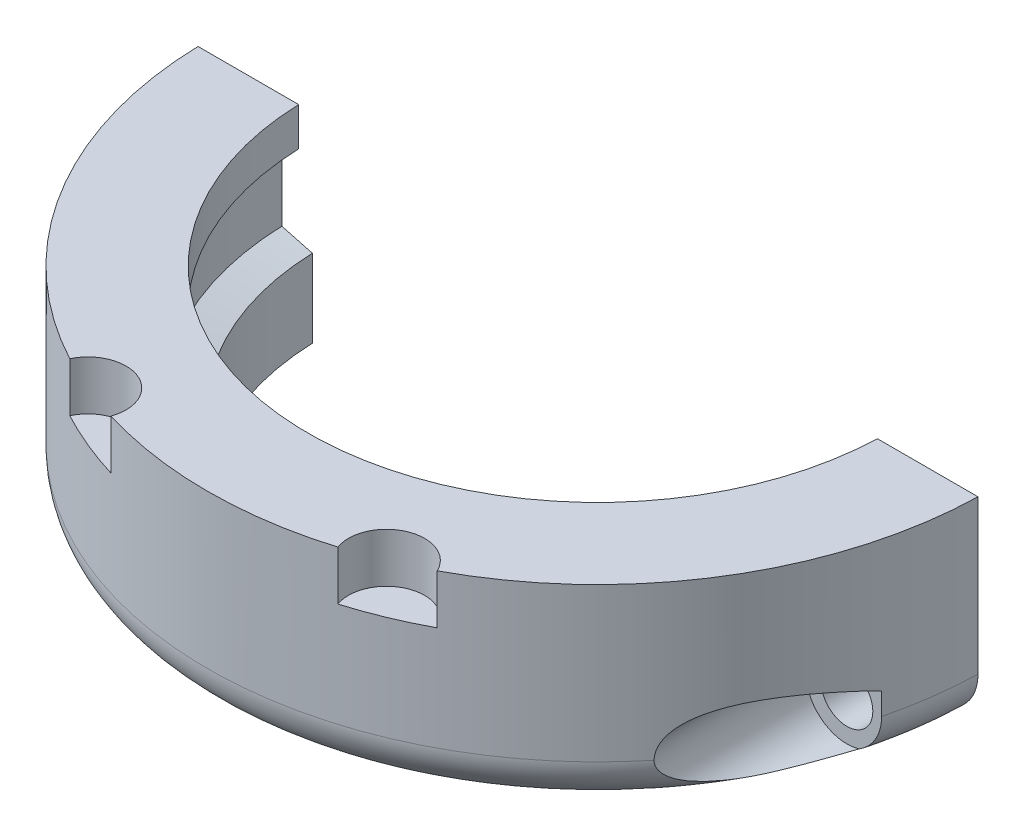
from build123d import *

# Parameters (mm, degrees)
SKETCH2_R              = 2.159
CUT_EXTRUDE2_DEPTH     = 55.458192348
SKETCH3_R              = 3.429
CUT_EXTRUDE3_DEPTH     = 55.458192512
SKETCH5_R              = 3.175
CUT_EXTRUDE9_DEPTH     = 4.1148
SKETCH4_W              = 88.9
SKETCH4_H              = 38.1
CUT_EXTRUDE_3256_DEPTH = 49.904967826


with BuildPart() as part:
    # Sketch1 → Base-Revolve (revolve)
    with BuildSketch(Plane.XY):
        with BuildLine():
            Line((22.987, 0), (28.6512, 0))
            ThreePointArc((28.6512, 0), (31.381197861, 1.130802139), (32.512, 3.8608))
            Line((32.512, 3.8608), (32.512, 16.6624))
            Line((32.512, 16.6624), (24.13, 16.6624))
            Line((24.13, 16.6624), (24.13, 13.456790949))
            Line((24.13, 13.456790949), (25.527, 13.456790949))
            Line((25.527, 13.456790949), (25.527, 7.182990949))
            Line((25.527, 7.182990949), (22.987, 6.5024))
            Line((22.987, 6.5024), (22.987, 0))
        make_face()
    revolve(axis=Axis((0, 0, 0), (0, 1, 0)))

    # Sketch2 → Cut-Extrude2 (cut, through all)
    with BuildSketch(Plane.XY.offset(7.874)):
        with Locations((-28.6512, 3.8608)):
            Circle(SKETCH2_R)
        with Locations((28.6512, 3.8608)):
            Circle(SKETCH2_R)
    extrude(amount=-CUT_EXTRUDE2_DEPTH, mode=Mode.SUBTRACT)

    # Sketch3 → Cut-Extrude3 (cut, through all)
    with BuildSketch(Plane.XY.offset(7.874)):
        with Locations((28.6512, 3.8608)):
            Circle(SKETCH3_R)
        with Locations((-28.6512, 3.8608)):
            Circle(SKETCH3_R)
    extrude(amount=CUT_EXTRUDE3_DEPTH, mode=Mode.SUBTRACT)

    # Sketch5 → Cut-Extrude9 (cut)
    with BuildSketch(Plane(origin=(0, 16.6624, 0), x_dir=(-1, 0, 0), z_dir=(0, 1, 0))):
        with Locations((12.441803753, 30.037171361)):
            Circle(SKETCH5_R)
        with Locations((-12.441803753, 30.037171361)):
            Circle(SKETCH5_R)
        with Locations((-12.441803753, -30.037171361)):
            Circle(SKETCH5_R)
        with Locations((12.441803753, -30.037171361)):
            Circle(SKETCH5_R)
    extrude(amount=-CUT_EXTRUDE9_DEPTH, mode=Mode.SUBTRACT)

    # Sketch4 → Cut-Extrude-3256 (cut, through all)
    with BuildSketch(Plane(origin=(0, 16.6624, 0), x_dir=(1, 0, 0), z_dir=(0, 1, 0))):
        with Locations((0, 18.2499)):
            Rectangle(SKETCH4_W, SKETCH4_H)
    extrude(amount=-CUT_EXTRUDE_3256_DEPTH, mode=Mode.SUBTRACT)


solid = part.part
